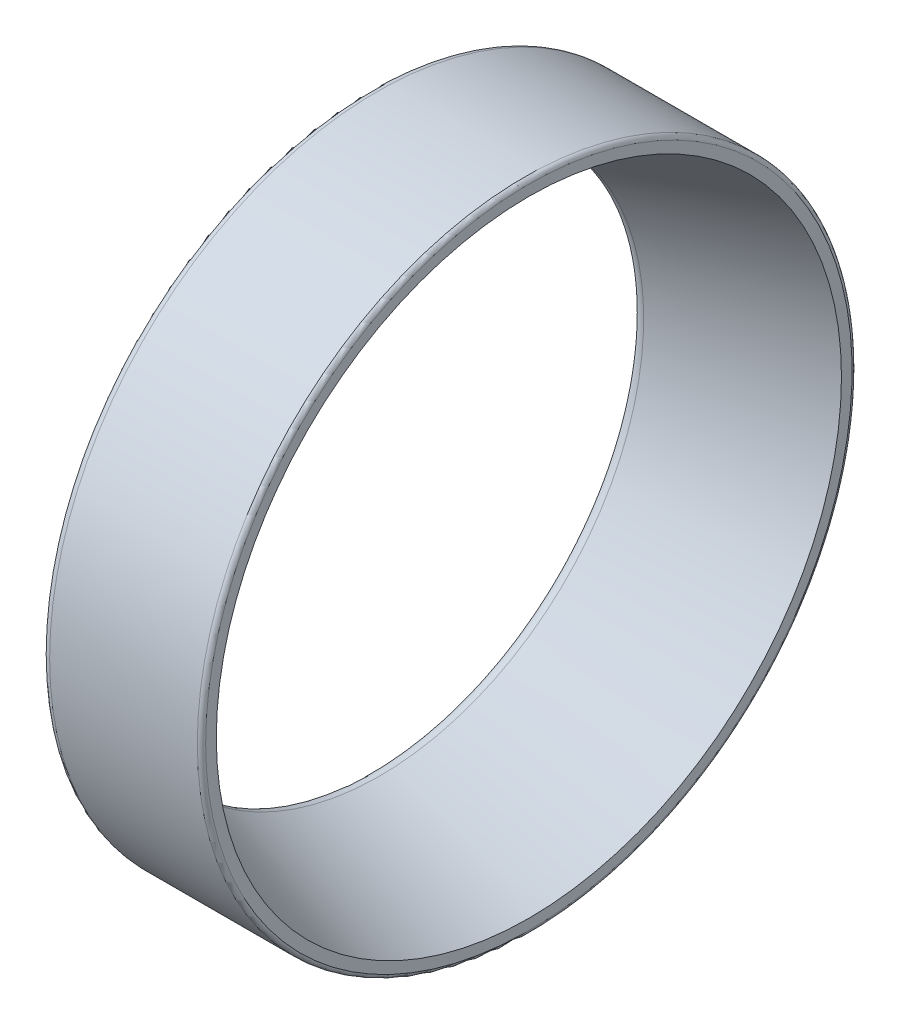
ISO-10303-21;
HEADER;
FILE_DESCRIPTION(('STEP AP214'),'2;1');
FILE_NAME('part.step','',(''),(''),'','','');
FILE_SCHEMA(('AUTOMOTIVE_DESIGN { 1 0 10303 214 1 1 1 1 }'));
ENDSEC;
DATA;
#1=APPLICATION_CONTEXT('core data for automotive mechanical design processes');
#2=APPLICATION_PROTOCOL_DEFINITION('international standard','automotive_design',2000,#1);
#3=PRODUCT_CONTEXT('',#1,'mechanical');
#4=PRODUCT('Part','Part','',(#3));
#5=PRODUCT_RELATED_PRODUCT_CATEGORY('part','',(#4));
#6=PRODUCT_DEFINITION_FORMATION('','',#4);
#7=PRODUCT_DEFINITION_CONTEXT('part definition',#1,'design');
#8=PRODUCT_DEFINITION('design','',#6,#7);
#9=PRODUCT_DEFINITION_SHAPE('','',#8);
#10=(LENGTH_UNIT() NAMED_UNIT(*) SI_UNIT(.MILLI.,.METRE.));
#11=(NAMED_UNIT(*) PLANE_ANGLE_UNIT() SI_UNIT($,.RADIAN.));
#12=(NAMED_UNIT(*) SI_UNIT($,.STERADIAN.) SOLID_ANGLE_UNIT());
#13=UNCERTAINTY_MEASURE_WITH_UNIT(LENGTH_MEASURE(1.E-05),#10,'distance_accuracy_value','');
#14=(GEOMETRIC_REPRESENTATION_CONTEXT(3) GLOBAL_UNCERTAINTY_ASSIGNED_CONTEXT((#13)) GLOBAL_UNIT_ASSIGNED_CONTEXT((#10,
#11,#12)) REPRESENTATION_CONTEXT('',''));
#15=CARTESIAN_POINT('',(0.,0.,0.));
#16=DIRECTION('',(0.,0.,1.));
#17=DIRECTION('',(1.,0.,0.));
#18=AXIS2_PLACEMENT_3D('',#15,#16,#17);
#19=CARTESIAN_POINT('',(0.6,0.,0.));
#20=DIRECTION('',(-1.,0.,0.));
#21=DIRECTION('',(0.,0.,1.));
#22=AXIS2_PLACEMENT_3D('',#19,#20,#21);
#23=TOROIDAL_SURFACE('',#22,19.5272143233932,0.6);
#24=CARTESIAN_POINT('',(0.785368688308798,0.,0.));
#25=DIRECTION('',(-1.,0.,0.));
#26=DIRECTION('',(0.,0.,1.));
#27=AXIS2_PLACEMENT_3D('',#24,#25,#26);
#28=CIRCLE('',#27,18.9565669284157);
#29=CARTESIAN_POINT('',(0.785368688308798,0.,18.9565669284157));
#30=VERTEX_POINT('',#29);
#31=EDGE_CURVE('E9',#30,#30,#28,.T.);
#32=ORIENTED_EDGE('',*,*,#31,.F.);
#33=EDGE_LOOP('',(#32));
#34=FACE_BOUND('',#33,.T.);
#35=CARTESIAN_POINT('',(0.,0.,0.));
#36=DIRECTION('',(-1.,0.,0.));
#37=DIRECTION('',(0.,0.,1.));
#38=AXIS2_PLACEMENT_3D('',#35,#36,#37);
#39=CIRCLE('',#38,19.5272143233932);
#40=CARTESIAN_POINT('',(0.,0.,19.5272143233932));
#41=VERTEX_POINT('',#40);
#42=EDGE_CURVE('E39',#41,#41,#39,.T.);
#43=ORIENTED_EDGE('',*,*,#42,.T.);
#44=EDGE_LOOP('',(#43));
#45=FACE_BOUND('',#44,.T.);
#46=ADVANCED_FACE('F14',(#34,#45),#23,.T.);
#47=CARTESIAN_POINT('',(0.785368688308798,0.,0.));
#48=DIRECTION('',(1.,0.,0.));
#49=DIRECTION('',(0.,0.,-1.));
#50=AXIS2_PLACEMENT_3D('',#47,#48,#49);
#51=CONICAL_SURFACE('',#50,18.9565669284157,0.314086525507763);
#52=CARTESIAN_POINT('',(11.5,0.,0.));
#53=DIRECTION('',(-1.,0.,0.));
#54=DIRECTION('',(0.,0.,1.));
#55=AXIS2_PLACEMENT_3D('',#52,#53,#54);
#56=CIRCLE('',#55,22.4371000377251);
#57=CARTESIAN_POINT('',(11.5,0.,22.4371000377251));
#58=VERTEX_POINT('',#57);
#59=EDGE_CURVE('E20',#58,#58,#56,.T.);
#60=ORIENTED_EDGE('',*,*,#59,.F.);
#61=EDGE_LOOP('',(#60));
#62=FACE_BOUND('',#61,.T.);
#63=ORIENTED_EDGE('',*,*,#31,.T.);
#64=EDGE_LOOP('',(#63));
#65=FACE_BOUND('',#64,.T.);
#66=ADVANCED_FACE('F70',(#62,#65),#51,.F.);
#67=CARTESIAN_POINT('',(11.5,22.4371000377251,0.));
#68=DIRECTION('',(-1.,0.,0.));
#69=DIRECTION('',(0.,0.,1.));
#70=AXIS2_PLACEMENT_3D('',#67,#68,#69);
#71=PLANE('',#70);
#72=CARTESIAN_POINT('',(11.5,0.,0.));
#73=DIRECTION('',(-1.,0.,0.));
#74=DIRECTION('',(0.,0.,1.));
#75=AXIS2_PLACEMENT_3D('',#72,#73,#74);
#76=CIRCLE('',#75,23.2);
#77=CARTESIAN_POINT('',(11.5,0.,23.2));
#78=VERTEX_POINT('',#77);
#79=EDGE_CURVE('E24',#78,#78,#76,.T.);
#80=ORIENTED_EDGE('',*,*,#79,.F.);
#81=EDGE_LOOP('',(#80));
#82=FACE_BOUND('',#81,.T.);
#83=ORIENTED_EDGE('',*,*,#59,.T.);
#84=EDGE_LOOP('',(#83));
#85=FACE_BOUND('',#84,.T.);
#86=ADVANCED_FACE('F65',(#82,#85),#71,.F.);
#87=CARTESIAN_POINT('',(11.2,0.,0.));
#88=DIRECTION('',(-1.,0.,0.));
#89=DIRECTION('',(0.,0.,1.));
#90=AXIS2_PLACEMENT_3D('',#87,#88,#89);
#91=TOROIDAL_SURFACE('',#90,23.2,0.3);
#92=CARTESIAN_POINT('',(11.2,0.,0.));
#93=DIRECTION('',(-1.,0.,0.));
#94=DIRECTION('',(0.,0.,1.));
#95=AXIS2_PLACEMENT_3D('',#92,#93,#94);
#96=CIRCLE('',#95,23.5);
#97=CARTESIAN_POINT('',(11.2,0.,23.5));
#98=VERTEX_POINT('',#97);
#99=EDGE_CURVE('E28',#98,#98,#96,.T.);
#100=ORIENTED_EDGE('',*,*,#99,.F.);
#101=EDGE_LOOP('',(#100));
#102=FACE_BOUND('',#101,.T.);
#103=ORIENTED_EDGE('',*,*,#79,.T.);
#104=EDGE_LOOP('',(#103));
#105=FACE_BOUND('',#104,.T.);
#106=ADVANCED_FACE('F59',(#102,#105),#91,.T.);
#107=CARTESIAN_POINT('',(0.,0.,0.));
#108=DIRECTION('',(-1.,0.,0.));
#109=DIRECTION('',(0.,0.,1.));
#110=AXIS2_PLACEMENT_3D('',#107,#108,#109);
#111=CYLINDRICAL_SURFACE('',#110,23.5);
#112=CARTESIAN_POINT('',(0.6,0.,0.));
#113=DIRECTION('',(-1.,0.,0.));
#114=DIRECTION('',(0.,0.,1.));
#115=AXIS2_PLACEMENT_3D('',#112,#113,#114);
#116=CIRCLE('',#115,23.5);
#117=CARTESIAN_POINT('',(0.6,0.,23.5));
#118=VERTEX_POINT('',#117);
#119=EDGE_CURVE('E33',#118,#118,#116,.T.);
#120=ORIENTED_EDGE('',*,*,#119,.F.);
#121=EDGE_LOOP('',(#120));
#122=FACE_BOUND('',#121,.T.);
#123=ORIENTED_EDGE('',*,*,#99,.T.);
#124=EDGE_LOOP('',(#123));
#125=FACE_BOUND('',#124,.T.);
#126=ADVANCED_FACE('F53',(#122,#125),#111,.T.);
#127=CARTESIAN_POINT('',(0.6,0.,0.));
#128=DIRECTION('',(-1.,0.,0.));
#129=DIRECTION('',(0.,0.,1.));
#130=AXIS2_PLACEMENT_3D('',#127,#128,#129);
#131=TOROIDAL_SURFACE('',#130,22.9,0.6);
#132=CARTESIAN_POINT('',(0.,0.,0.));
#133=DIRECTION('',(-1.,0.,0.));
#134=DIRECTION('',(0.,0.,1.));
#135=AXIS2_PLACEMENT_3D('',#132,#133,#134);
#136=CIRCLE('',#135,22.9);
#137=CARTESIAN_POINT('',(0.,0.,22.9));
#138=VERTEX_POINT('',#137);
#139=EDGE_CURVE('E36',#138,#138,#136,.T.);
#140=ORIENTED_EDGE('',*,*,#139,.F.);
#141=EDGE_LOOP('',(#140));
#142=FACE_BOUND('',#141,.T.);
#143=ORIENTED_EDGE('',*,*,#119,.T.);
#144=EDGE_LOOP('',(#143));
#145=FACE_BOUND('',#144,.T.);
#146=ADVANCED_FACE('F47',(#142,#145),#131,.T.);
#147=CARTESIAN_POINT('',(0.,22.9,0.));
#148=DIRECTION('',(1.,0.,0.));
#149=DIRECTION('',(0.,0.,-1.));
#150=AXIS2_PLACEMENT_3D('',#147,#148,#149);
#151=PLANE('',#150);
#152=ORIENTED_EDGE('',*,*,#42,.F.);
#153=EDGE_LOOP('',(#152));
#154=FACE_BOUND('',#153,.T.);
#155=ORIENTED_EDGE('',*,*,#139,.T.);
#156=EDGE_LOOP('',(#155));
#157=FACE_BOUND('',#156,.T.);
#158=ADVANCED_FACE('F44',(#154,#157),#151,.F.);
#159=CLOSED_SHELL('',(#46,#66,#86,#106,#126,#146,#158));
#160=MANIFOLD_SOLID_BREP('B1',#159);
#161=ADVANCED_BREP_SHAPE_REPRESENTATION('',(#18,#160),#14);
#162=SHAPE_DEFINITION_REPRESENTATION(#9,#161);
ENDSEC;
END-ISO-10303-21;
